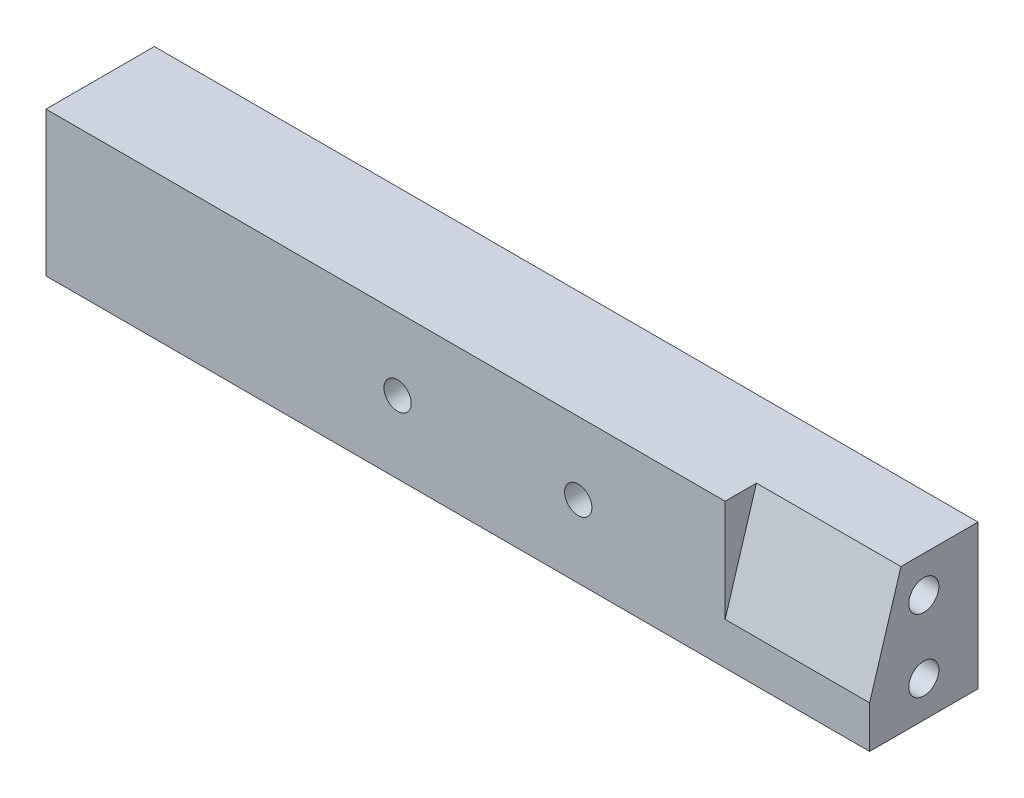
ISO-10303-21;
HEADER;
FILE_DESCRIPTION(('STEP AP214'),'2;1');
FILE_NAME('part.step','',(''),(''),'','','');
FILE_SCHEMA(('AUTOMOTIVE_DESIGN { 1 0 10303 214 1 1 1 1 }'));
ENDSEC;
DATA;
#1=APPLICATION_CONTEXT('core data for automotive mechanical design processes');
#2=APPLICATION_PROTOCOL_DEFINITION('international standard','automotive_design',2000,#1);
#3=PRODUCT_CONTEXT('',#1,'mechanical');
#4=PRODUCT('Part','Part','',(#3));
#5=PRODUCT_RELATED_PRODUCT_CATEGORY('part','',(#4));
#6=PRODUCT_DEFINITION_FORMATION('','',#4);
#7=PRODUCT_DEFINITION_CONTEXT('part definition',#1,'design');
#8=PRODUCT_DEFINITION('design','',#6,#7);
#9=PRODUCT_DEFINITION_SHAPE('','',#8);
#10=(LENGTH_UNIT() NAMED_UNIT(*) SI_UNIT(.MILLI.,.METRE.));
#11=(NAMED_UNIT(*) PLANE_ANGLE_UNIT() SI_UNIT($,.RADIAN.));
#12=(NAMED_UNIT(*) SI_UNIT($,.STERADIAN.) SOLID_ANGLE_UNIT());
#13=UNCERTAINTY_MEASURE_WITH_UNIT(LENGTH_MEASURE(1.E-05),#10,'distance_accuracy_value','');
#14=(GEOMETRIC_REPRESENTATION_CONTEXT(3) GLOBAL_UNCERTAINTY_ASSIGNED_CONTEXT((#13)) GLOBAL_UNIT_ASSIGNED_CONTEXT((#10,
#11,#12)) REPRESENTATION_CONTEXT('',''));
#15=CARTESIAN_POINT('',(0.,0.,0.));
#16=DIRECTION('',(0.,0.,1.));
#17=DIRECTION('',(1.,0.,0.));
#18=AXIS2_PLACEMENT_3D('',#15,#16,#17);
#19=CARTESIAN_POINT('',(68.4,6.,4.5));
#20=DIRECTION('',(0.,-1.,0.));
#21=DIRECTION('',(0.,0.,-1.));
#22=AXIS2_PLACEMENT_3D('',#19,#20,#21);
#23=PLANE('',#22);
#24=DIRECTION('',(1.,0.,0.));
#25=VECTOR('',#24,1.);
#26=CARTESIAN_POINT('',(56.4,6.,1.9));
#27=LINE('',#26,#25);
#28=CARTESIAN_POINT('',(56.4,6.,1.9));
#29=VERTEX_POINT('',#28);
#30=CARTESIAN_POINT('',(68.4,6.,1.9));
#31=VERTEX_POINT('',#30);
#32=EDGE_CURVE('E110',#29,#31,#27,.T.);
#33=ORIENTED_EDGE('',*,*,#32,.T.);
#34=DIRECTION('',(0.,0.,1.));
#35=VECTOR('',#34,1.);
#36=CARTESIAN_POINT('',(68.4,6.,-3.02658526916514));
#37=LINE('',#36,#35);
#38=CARTESIAN_POINT('',(68.4,6.,-4.5));
#39=VERTEX_POINT('',#38);
#40=EDGE_CURVE('E88',#39,#31,#37,.T.);
#41=ORIENTED_EDGE('',*,*,#40,.F.);
#42=DIRECTION('',(-1.,0.,0.));
#43=VECTOR('',#42,1.);
#44=CARTESIAN_POINT('',(68.4,6.,-4.5));
#45=LINE('',#44,#43);
#46=CARTESIAN_POINT('',(0.,6.,-4.5));
#47=VERTEX_POINT('',#46);
#48=EDGE_CURVE('E11',#39,#47,#45,.T.);
#49=ORIENTED_EDGE('',*,*,#48,.T.);
#50=DIRECTION('',(0.,0.,1.));
#51=VECTOR('',#50,1.);
#52=CARTESIAN_POINT('',(0.,6.,4.5));
#53=LINE('',#52,#51);
#54=CARTESIAN_POINT('',(0.,6.,4.5));
#55=VERTEX_POINT('',#54);
#56=EDGE_CURVE('E178',#47,#55,#53,.T.);
#57=ORIENTED_EDGE('',*,*,#56,.T.);
#58=DIRECTION('',(-1.,0.,0.));
#59=VECTOR('',#58,1.);
#60=CARTESIAN_POINT('',(68.4,6.,4.5));
#61=LINE('',#60,#59);
#62=CARTESIAN_POINT('',(56.4,6.,4.5));
#63=VERTEX_POINT('',#62);
#64=EDGE_CURVE('E45',#63,#55,#61,.T.);
#65=ORIENTED_EDGE('',*,*,#64,.F.);
#66=DIRECTION('',(0.,0.,1.));
#67=VECTOR('',#66,1.);
#68=CARTESIAN_POINT('',(56.4,6.,0.));
#69=LINE('',#68,#67);
#70=EDGE_CURVE('E121',#29,#63,#69,.T.);
#71=ORIENTED_EDGE('',*,*,#70,.F.);
#72=EDGE_LOOP('',(#33,#41,#49,#57,#65,#71));
#73=FACE_BOUND('',#72,.T.);
#74=ADVANCED_FACE('F36',(#73),#23,.F.);
#75=CARTESIAN_POINT('',(68.4,-6.,4.5));
#76=DIRECTION('',(0.,0.,-1.));
#77=DIRECTION('',(-1.,0.,0.));
#78=AXIS2_PLACEMENT_3D('',#75,#76,#77);
#79=PLANE('',#78);
#80=CARTESIAN_POINT('',(29.2000000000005,0.,4.5));
#81=DIRECTION('',(0.,0.,-1.));
#82=DIRECTION('',(-1.,0.,0.));
#83=AXIS2_PLACEMENT_3D('',#80,#81,#82);
#84=CIRCLE('',#83,1.13350043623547);
#85=CARTESIAN_POINT('',(28.066499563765,0.,4.5));
#86=VERTEX_POINT('',#85);
#87=EDGE_CURVE('E143',#86,#86,#84,.T.);
#88=ORIENTED_EDGE('',*,*,#87,.T.);
#89=EDGE_LOOP('',(#88));
#90=FACE_BOUND('',#89,.T.);
#91=CARTESIAN_POINT('',(44.2000000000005,0.,4.5));
#92=DIRECTION('',(0.,0.,-1.));
#93=DIRECTION('',(-1.,0.,0.));
#94=AXIS2_PLACEMENT_3D('',#91,#92,#93);
#95=CIRCLE('',#94,1.13350043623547);
#96=CARTESIAN_POINT('',(43.066499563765,0.,4.5));
#97=VERTEX_POINT('',#96);
#98=EDGE_CURVE('E40',#97,#97,#95,.T.);
#99=ORIENTED_EDGE('',*,*,#98,.T.);
#100=EDGE_LOOP('',(#99));
#101=FACE_BOUND('',#100,.T.);
#102=DIRECTION('',(1.,0.,0.));
#103=VECTOR('',#102,1.);
#104=CARTESIAN_POINT('',(56.4,-2.5,4.5));
#105=LINE('',#104,#103);
#106=CARTESIAN_POINT('',(56.4,-2.5,4.5));
#107=VERTEX_POINT('',#106);
#108=CARTESIAN_POINT('',(68.4,-2.5,4.5));
#109=VERTEX_POINT('',#108);
#110=EDGE_CURVE('E53',#107,#109,#105,.T.);
#111=ORIENTED_EDGE('',*,*,#110,.F.);
#112=DIRECTION('',(0.,-1.,0.));
#113=VECTOR('',#112,1.);
#114=CARTESIAN_POINT('',(56.4,0.,4.5));
#115=LINE('',#114,#113);
#116=EDGE_CURVE('E117',#63,#107,#115,.T.);
#117=ORIENTED_EDGE('',*,*,#116,.F.);
#118=ORIENTED_EDGE('',*,*,#64,.T.);
#119=DIRECTION('',(0.,-1.,0.));
#120=VECTOR('',#119,1.);
#121=CARTESIAN_POINT('',(0.,-6.,4.5));
#122=LINE('',#121,#120);
#123=CARTESIAN_POINT('',(0.,-6.,4.5));
#124=VERTEX_POINT('',#123);
#125=EDGE_CURVE('E180',#55,#124,#122,.T.);
#126=ORIENTED_EDGE('',*,*,#125,.T.);
#127=DIRECTION('',(-1.,0.,0.));
#128=VECTOR('',#127,1.);
#129=CARTESIAN_POINT('',(68.4,-6.,4.5));
#130=LINE('',#129,#128);
#131=CARTESIAN_POINT('',(68.4,-6.,4.5));
#132=VERTEX_POINT('',#131);
#133=EDGE_CURVE('E184',#132,#124,#130,.T.);
#134=ORIENTED_EDGE('',*,*,#133,.F.);
#135=DIRECTION('',(0.,-1.,0.));
#136=VECTOR('',#135,1.);
#137=CARTESIAN_POINT('',(68.4,-6.,4.5));
#138=LINE('',#137,#136);
#139=EDGE_CURVE('E172',#109,#132,#138,.T.);
#140=ORIENTED_EDGE('',*,*,#139,.F.);
#141=EDGE_LOOP('',(#111,#117,#118,#126,#134,#140));
#142=FACE_BOUND('',#141,.T.);
#143=ADVANCED_FACE('F189',(#90,#101,#142),#79,.F.);
#144=CARTESIAN_POINT('',(68.4,0.,0.));
#145=DIRECTION('',(1.,0.,0.));
#146=DIRECTION('',(0.,0.,-1.));
#147=AXIS2_PLACEMENT_3D('',#144,#145,#146);
#148=PLANE('',#147);
#149=CARTESIAN_POINT('',(68.4,-3.,0.));
#150=DIRECTION('',(1.,0.,0.));
#151=DIRECTION('',(0.,0.,-1.));
#152=AXIS2_PLACEMENT_3D('',#149,#150,#151);
#153=CIRCLE('',#152,1.24999999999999);
#154=CARTESIAN_POINT('',(68.4,-3.,-1.24999999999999));
#155=VERTEX_POINT('',#154);
#156=EDGE_CURVE('E156',#155,#155,#153,.T.);
#157=ORIENTED_EDGE('',*,*,#156,.F.);
#158=EDGE_LOOP('',(#157));
#159=FACE_BOUND('',#158,.T.);
#160=CARTESIAN_POINT('',(68.4,3.,0.));
#161=DIRECTION('',(1.,0.,0.));
#162=DIRECTION('',(0.,0.,-1.));
#163=AXIS2_PLACEMENT_3D('',#160,#161,#162);
#164=CIRCLE('',#163,1.24999999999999);
#165=CARTESIAN_POINT('',(68.4,3.,-1.24999999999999));
#166=VERTEX_POINT('',#165);
#167=EDGE_CURVE('E162',#166,#166,#164,.T.);
#168=ORIENTED_EDGE('',*,*,#167,.F.);
#169=EDGE_LOOP('',(#168));
#170=FACE_BOUND('',#169,.T.);
#171=ORIENTED_EDGE('',*,*,#40,.T.);
#172=DIRECTION('',(0.,-0.956264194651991,0.29250434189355));
#173=VECTOR('',#172,1.);
#174=CARTESIAN_POINT('',(68.4,1.04480445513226,3.41570687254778));
#175=LINE('',#174,#173);
#176=EDGE_CURVE('E115',#31,#109,#175,.T.);
#177=ORIENTED_EDGE('',*,*,#176,.T.);
#178=ORIENTED_EDGE('',*,*,#139,.T.);
#179=DIRECTION('',(0.,0.,-1.));
#180=VECTOR('',#179,1.);
#181=CARTESIAN_POINT('',(68.4,-6.,4.5));
#182=LINE('',#181,#180);
#183=CARTESIAN_POINT('',(68.4,-6.,-4.5));
#184=VERTEX_POINT('',#183);
#185=EDGE_CURVE('E62',#132,#184,#182,.T.);
#186=ORIENTED_EDGE('',*,*,#185,.T.);
#187=DIRECTION('',(0.,1.,0.));
#188=VECTOR('',#187,1.);
#189=CARTESIAN_POINT('',(68.4,6.,-4.5));
#190=LINE('',#189,#188);
#191=EDGE_CURVE('E169',#184,#39,#190,.T.);
#192=ORIENTED_EDGE('',*,*,#191,.T.);
#193=EDGE_LOOP('',(#171,#177,#178,#186,#192));
#194=FACE_BOUND('',#193,.T.);
#195=ADVANCED_FACE('F212',(#159,#170,#194),#148,.T.);
#196=CARTESIAN_POINT('',(68.4,6.,-4.5));
#197=DIRECTION('',(0.,0.,1.));
#198=DIRECTION('',(1.,0.,0.));
#199=AXIS2_PLACEMENT_3D('',#196,#197,#198);
#200=PLANE('',#199);
#201=CARTESIAN_POINT('',(44.2000000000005,0.,-4.5));
#202=DIRECTION('',(0.,0.,-1.));
#203=DIRECTION('',(-1.,0.,0.));
#204=AXIS2_PLACEMENT_3D('',#201,#202,#203);
#205=CIRCLE('',#204,1.24999999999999);
#206=CARTESIAN_POINT('',(42.9500000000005,0.,-4.5));
#207=VERTEX_POINT('',#206);
#208=EDGE_CURVE('E130',#207,#207,#205,.T.);
#209=ORIENTED_EDGE('',*,*,#208,.F.);
#210=EDGE_LOOP('',(#209));
#211=FACE_BOUND('',#210,.T.);
#212=CARTESIAN_POINT('',(29.2000000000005,0.,-4.5));
#213=DIRECTION('',(0.,0.,-1.));
#214=DIRECTION('',(-1.,0.,0.));
#215=AXIS2_PLACEMENT_3D('',#212,#213,#214);
#216=CIRCLE('',#215,1.24999999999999);
#217=CARTESIAN_POINT('',(27.9500000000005,0.,-4.5));
#218=VERTEX_POINT('',#217);
#219=EDGE_CURVE('E137',#218,#218,#216,.T.);
#220=ORIENTED_EDGE('',*,*,#219,.F.);
#221=EDGE_LOOP('',(#220));
#222=FACE_BOUND('',#221,.T.);
#223=DIRECTION('',(0.,1.,0.));
#224=VECTOR('',#223,1.);
#225=CARTESIAN_POINT('',(0.,6.,-4.5));
#226=LINE('',#225,#224);
#227=CARTESIAN_POINT('',(0.,-6.,-4.5));
#228=VERTEX_POINT('',#227);
#229=EDGE_CURVE('E168',#228,#47,#226,.T.);
#230=ORIENTED_EDGE('',*,*,#229,.T.);
#231=ORIENTED_EDGE('',*,*,#48,.F.);
#232=ORIENTED_EDGE('',*,*,#191,.F.);
#233=DIRECTION('',(-1.,0.,0.));
#234=VECTOR('',#233,1.);
#235=CARTESIAN_POINT('',(68.4,-6.,-4.5));
#236=LINE('',#235,#234);
#237=EDGE_CURVE('E175',#184,#228,#236,.T.);
#238=ORIENTED_EDGE('',*,*,#237,.T.);
#239=EDGE_LOOP('',(#230,#231,#232,#238));
#240=FACE_BOUND('',#239,.T.);
#241=ADVANCED_FACE('F38',(#211,#222,#240),#200,.F.);
#242=CARTESIAN_POINT('',(68.4,-6.,4.5));
#243=DIRECTION('',(0.,1.,0.));
#244=DIRECTION('',(0.,0.,1.));
#245=AXIS2_PLACEMENT_3D('',#242,#243,#244);
#246=PLANE('',#245);
#247=DIRECTION('',(0.,0.,-1.));
#248=VECTOR('',#247,1.);
#249=CARTESIAN_POINT('',(0.,-6.,4.5));
#250=LINE('',#249,#248);
#251=EDGE_CURVE('E82',#124,#228,#250,.T.);
#252=ORIENTED_EDGE('',*,*,#251,.T.);
#253=ORIENTED_EDGE('',*,*,#237,.F.);
#254=ORIENTED_EDGE('',*,*,#185,.F.);
#255=ORIENTED_EDGE('',*,*,#133,.T.);
#256=EDGE_LOOP('',(#252,#253,#254,#255));
#257=FACE_BOUND('',#256,.T.);
#258=ADVANCED_FACE('F215',(#257),#246,.F.);
#259=CARTESIAN_POINT('',(0.,0.,0.));
#260=DIRECTION('',(1.,0.,0.));
#261=DIRECTION('',(0.,0.,-1.));
#262=AXIS2_PLACEMENT_3D('',#259,#260,#261);
#263=PLANE('',#262);
#264=CARTESIAN_POINT('',(0.,3.,0.));
#265=DIRECTION('',(-1.,0.,0.));
#266=DIRECTION('',(0.,0.,1.));
#267=AXIS2_PLACEMENT_3D('',#264,#265,#266);
#268=CIRCLE('',#267,1.24999999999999);
#269=CARTESIAN_POINT('',(0.,3.,1.24999999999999));
#270=VERTEX_POINT('',#269);
#271=EDGE_CURVE('E144',#270,#270,#268,.T.);
#272=ORIENTED_EDGE('',*,*,#271,.F.);
#273=EDGE_LOOP('',(#272));
#274=FACE_BOUND('',#273,.T.);
#275=CARTESIAN_POINT('',(0.,-3.,0.));
#276=DIRECTION('',(-1.,0.,0.));
#277=DIRECTION('',(0.,0.,1.));
#278=AXIS2_PLACEMENT_3D('',#275,#276,#277);
#279=CIRCLE('',#278,1.24999999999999);
#280=CARTESIAN_POINT('',(0.,-3.,1.24999999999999));
#281=VERTEX_POINT('',#280);
#282=EDGE_CURVE('E150',#281,#281,#279,.T.);
#283=ORIENTED_EDGE('',*,*,#282,.F.);
#284=EDGE_LOOP('',(#283));
#285=FACE_BOUND('',#284,.T.);
#286=ORIENTED_EDGE('',*,*,#229,.F.);
#287=ORIENTED_EDGE('',*,*,#251,.F.);
#288=ORIENTED_EDGE('',*,*,#125,.F.);
#289=ORIENTED_EDGE('',*,*,#56,.F.);
#290=EDGE_LOOP('',(#286,#287,#288,#289));
#291=FACE_BOUND('',#290,.T.);
#292=ADVANCED_FACE('F218',(#274,#285,#291),#263,.F.);
#293=CARTESIAN_POINT('',(59.9,3.,0.));
#294=DIRECTION('',(1.,0.,0.));
#295=DIRECTION('',(0.,0.,-1.));
#296=AXIS2_PLACEMENT_3D('',#293,#294,#295);
#297=CONICAL_SURFACE('',#296,1.25,1.02974425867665);
#298=CARTESIAN_POINT('',(59.1489242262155,3.,0.));
#299=VERTEX_POINT('',#298);
#300=VERTEX_LOOP('',#299);
#301=FACE_BOUND('',#300,.T.);
#302=CARTESIAN_POINT('',(59.9,3.,0.));
#303=DIRECTION('',(1.,0.,0.));
#304=DIRECTION('',(0.,0.,-1.));
#305=AXIS2_PLACEMENT_3D('',#302,#303,#304);
#306=CIRCLE('',#305,1.25);
#307=CARTESIAN_POINT('',(59.9,3.,-1.25));
#308=VERTEX_POINT('',#307);
#309=EDGE_CURVE('E165',#308,#308,#306,.T.);
#310=ORIENTED_EDGE('',*,*,#309,.T.);
#311=EDGE_LOOP('',(#310));
#312=FACE_BOUND('',#311,.T.);
#313=ADVANCED_FACE('F221',(#301,#312),#297,.F.);
#314=CARTESIAN_POINT('',(68.4,3.,0.));
#315=DIRECTION('',(1.,0.,0.));
#316=DIRECTION('',(0.,0.,-1.));
#317=AXIS2_PLACEMENT_3D('',#314,#315,#316);
#318=CYLINDRICAL_SURFACE('',#317,1.24999999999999);
#319=ORIENTED_EDGE('',*,*,#309,.F.);
#320=EDGE_LOOP('',(#319));
#321=FACE_BOUND('',#320,.T.);
#322=ORIENTED_EDGE('',*,*,#167,.T.);
#323=EDGE_LOOP('',(#322));
#324=FACE_BOUND('',#323,.T.);
#325=ADVANCED_FACE('F228',(#321,#324),#318,.F.);
#326=CARTESIAN_POINT('',(59.9,-3.,0.));
#327=DIRECTION('',(1.,0.,0.));
#328=DIRECTION('',(0.,0.,-1.));
#329=AXIS2_PLACEMENT_3D('',#326,#327,#328);
#330=CONICAL_SURFACE('',#329,1.25,1.02974425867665);
#331=CARTESIAN_POINT('',(59.1489242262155,-3.,0.));
#332=VERTEX_POINT('',#331);
#333=VERTEX_LOOP('',#332);
#334=FACE_BOUND('',#333,.T.);
#335=CARTESIAN_POINT('',(59.9,-3.,0.));
#336=DIRECTION('',(1.,0.,0.));
#337=DIRECTION('',(0.,0.,-1.));
#338=AXIS2_PLACEMENT_3D('',#335,#336,#337);
#339=CIRCLE('',#338,1.25);
#340=CARTESIAN_POINT('',(59.9,-3.,-1.25));
#341=VERTEX_POINT('',#340);
#342=EDGE_CURVE('E159',#341,#341,#339,.T.);
#343=ORIENTED_EDGE('',*,*,#342,.T.);
#344=EDGE_LOOP('',(#343));
#345=FACE_BOUND('',#344,.T.);
#346=ADVANCED_FACE('F232',(#334,#345),#330,.F.);
#347=CARTESIAN_POINT('',(68.4,-3.,0.));
#348=DIRECTION('',(1.,0.,0.));
#349=DIRECTION('',(0.,0.,-1.));
#350=AXIS2_PLACEMENT_3D('',#347,#348,#349);
#351=CYLINDRICAL_SURFACE('',#350,1.24999999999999);
#352=ORIENTED_EDGE('',*,*,#342,.F.);
#353=EDGE_LOOP('',(#352));
#354=FACE_BOUND('',#353,.T.);
#355=ORIENTED_EDGE('',*,*,#156,.T.);
#356=EDGE_LOOP('',(#355));
#357=FACE_BOUND('',#356,.T.);
#358=ADVANCED_FACE('F236',(#354,#357),#351,.F.);
#359=CARTESIAN_POINT('',(8.49999999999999,-3.,0.));
#360=DIRECTION('',(-1.,0.,0.));
#361=DIRECTION('',(0.,0.,1.));
#362=AXIS2_PLACEMENT_3D('',#359,#360,#361);
#363=CONICAL_SURFACE('',#362,1.24999999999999,1.02974425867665);
#364=CARTESIAN_POINT('',(9.25107577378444,-3.,0.));
#365=VERTEX_POINT('',#364);
#366=VERTEX_LOOP('',#365);
#367=FACE_BOUND('',#366,.T.);
#368=CARTESIAN_POINT('',(8.49999999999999,-3.,0.));
#369=DIRECTION('',(-1.,0.,0.));
#370=DIRECTION('',(0.,0.,1.));
#371=AXIS2_PLACEMENT_3D('',#368,#369,#370);
#372=CIRCLE('',#371,1.24999999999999);
#373=CARTESIAN_POINT('',(8.49999999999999,-3.,1.24999999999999));
#374=VERTEX_POINT('',#373);
#375=EDGE_CURVE('E153',#374,#374,#372,.T.);
#376=ORIENTED_EDGE('',*,*,#375,.T.);
#377=EDGE_LOOP('',(#376));
#378=FACE_BOUND('',#377,.T.);
#379=ADVANCED_FACE('F240',(#367,#378),#363,.F.);
#380=CARTESIAN_POINT('',(0.,-3.,0.));
#381=DIRECTION('',(-1.,0.,0.));
#382=DIRECTION('',(0.,0.,1.));
#383=AXIS2_PLACEMENT_3D('',#380,#381,#382);
#384=CYLINDRICAL_SURFACE('',#383,1.24999999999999);
#385=ORIENTED_EDGE('',*,*,#375,.F.);
#386=EDGE_LOOP('',(#385));
#387=FACE_BOUND('',#386,.T.);
#388=ORIENTED_EDGE('',*,*,#282,.T.);
#389=EDGE_LOOP('',(#388));
#390=FACE_BOUND('',#389,.T.);
#391=ADVANCED_FACE('F244',(#387,#390),#384,.F.);
#392=CARTESIAN_POINT('',(8.49999999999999,3.,0.));
#393=DIRECTION('',(-1.,0.,0.));
#394=DIRECTION('',(0.,0.,1.));
#395=AXIS2_PLACEMENT_3D('',#392,#393,#394);
#396=CONICAL_SURFACE('',#395,1.24999999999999,1.02974425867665);
#397=CARTESIAN_POINT('',(9.25107577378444,3.,0.));
#398=VERTEX_POINT('',#397);
#399=VERTEX_LOOP('',#398);
#400=FACE_BOUND('',#399,.T.);
#401=CARTESIAN_POINT('',(8.49999999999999,3.,0.));
#402=DIRECTION('',(-1.,0.,0.));
#403=DIRECTION('',(0.,0.,1.));
#404=AXIS2_PLACEMENT_3D('',#401,#402,#403);
#405=CIRCLE('',#404,1.24999999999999);
#406=CARTESIAN_POINT('',(8.49999999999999,3.,1.24999999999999));
#407=VERTEX_POINT('',#406);
#408=EDGE_CURVE('E147',#407,#407,#405,.T.);
#409=ORIENTED_EDGE('',*,*,#408,.T.);
#410=EDGE_LOOP('',(#409));
#411=FACE_BOUND('',#410,.T.);
#412=ADVANCED_FACE('F205',(#400,#411),#396,.F.);
#413=CARTESIAN_POINT('',(0.,3.,0.));
#414=DIRECTION('',(-1.,0.,0.));
#415=DIRECTION('',(0.,0.,1.));
#416=AXIS2_PLACEMENT_3D('',#413,#414,#415);
#417=CYLINDRICAL_SURFACE('',#416,1.24999999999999);
#418=ORIENTED_EDGE('',*,*,#408,.F.);
#419=EDGE_LOOP('',(#418));
#420=FACE_BOUND('',#419,.T.);
#421=ORIENTED_EDGE('',*,*,#271,.T.);
#422=EDGE_LOOP('',(#421));
#423=FACE_BOUND('',#422,.T.);
#424=ADVANCED_FACE('F195',(#420,#423),#417,.F.);
#425=CARTESIAN_POINT('',(29.2000000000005,0.,4.43));
#426=DIRECTION('',(0.,0.,-1.));
#427=DIRECTION('',(-1.,0.,0.));
#428=AXIS2_PLACEMENT_3D('',#425,#426,#427);
#429=CONICAL_SURFACE('',#428,1.25,1.02974425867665);
#430=CARTESIAN_POINT('',(29.2000000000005,0.,4.43));
#431=DIRECTION('',(0.,0.,-1.));
#432=DIRECTION('',(-1.,0.,0.));
#433=AXIS2_PLACEMENT_3D('',#430,#431,#432);
#434=CIRCLE('',#433,1.25);
#435=CARTESIAN_POINT('',(27.9500000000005,0.,4.43));
#436=VERTEX_POINT('',#435);
#437=EDGE_CURVE('E140',#436,#436,#434,.T.);
#438=ORIENTED_EDGE('',*,*,#437,.T.);
#439=EDGE_LOOP('',(#438));
#440=FACE_BOUND('',#439,.T.);
#441=ORIENTED_EDGE('',*,*,#87,.F.);
#442=EDGE_LOOP('',(#441));
#443=FACE_BOUND('',#442,.T.);
#444=ADVANCED_FACE('F192',(#440,#443),#429,.F.);
#445=CARTESIAN_POINT('',(29.2000000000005,0.,-4.5));
#446=DIRECTION('',(0.,0.,-1.));
#447=DIRECTION('',(-1.,0.,0.));
#448=AXIS2_PLACEMENT_3D('',#445,#446,#447);
#449=CYLINDRICAL_SURFACE('',#448,1.24999999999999);
#450=ORIENTED_EDGE('',*,*,#437,.F.);
#451=EDGE_LOOP('',(#450));
#452=FACE_BOUND('',#451,.T.);
#453=ORIENTED_EDGE('',*,*,#219,.T.);
#454=EDGE_LOOP('',(#453));
#455=FACE_BOUND('',#454,.T.);
#456=ADVANCED_FACE('F194',(#452,#455),#449,.F.);
#457=CARTESIAN_POINT('',(44.2000000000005,0.,4.43));
#458=DIRECTION('',(0.,0.,-1.));
#459=DIRECTION('',(-1.,0.,0.));
#460=AXIS2_PLACEMENT_3D('',#457,#458,#459);
#461=CONICAL_SURFACE('',#460,1.25,1.02974425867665);
#462=CARTESIAN_POINT('',(44.2000000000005,0.,4.43));
#463=DIRECTION('',(0.,0.,-1.));
#464=DIRECTION('',(-1.,0.,0.));
#465=AXIS2_PLACEMENT_3D('',#462,#463,#464);
#466=CIRCLE('',#465,1.25);
#467=CARTESIAN_POINT('',(42.9500000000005,0.,4.43));
#468=VERTEX_POINT('',#467);
#469=EDGE_CURVE('E134',#468,#468,#466,.T.);
#470=ORIENTED_EDGE('',*,*,#469,.T.);
#471=EDGE_LOOP('',(#470));
#472=FACE_BOUND('',#471,.T.);
#473=ORIENTED_EDGE('',*,*,#98,.F.);
#474=EDGE_LOOP('',(#473));
#475=FACE_BOUND('',#474,.T.);
#476=ADVANCED_FACE('F202',(#472,#475),#461,.F.);
#477=CARTESIAN_POINT('',(44.2000000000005,0.,-4.5));
#478=DIRECTION('',(0.,0.,-1.));
#479=DIRECTION('',(-1.,0.,0.));
#480=AXIS2_PLACEMENT_3D('',#477,#478,#479);
#481=CYLINDRICAL_SURFACE('',#480,1.24999999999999);
#482=ORIENTED_EDGE('',*,*,#469,.F.);
#483=EDGE_LOOP('',(#482));
#484=FACE_BOUND('',#483,.T.);
#485=ORIENTED_EDGE('',*,*,#208,.T.);
#486=EDGE_LOOP('',(#485));
#487=FACE_BOUND('',#486,.T.);
#488=ADVANCED_FACE('F277',(#484,#487),#481,.F.);
#489=CARTESIAN_POINT('',(56.4,1.04480445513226,3.41570687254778));
#490=DIRECTION('',(0.,0.29250434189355,0.956264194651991));
#491=DIRECTION('',(0.,-0.956264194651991,0.29250434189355));
#492=AXIS2_PLACEMENT_3D('',#489,#490,#491);
#493=PLANE('',#492);
#494=ORIENTED_EDGE('',*,*,#176,.F.);
#495=ORIENTED_EDGE('',*,*,#32,.F.);
#496=DIRECTION('',(0.,-0.956264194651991,0.29250434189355));
#497=VECTOR('',#496,1.);
#498=CARTESIAN_POINT('',(56.4,1.04480445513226,3.41570687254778));
#499=LINE('',#498,#497);
#500=EDGE_CURVE('E113',#29,#107,#499,.T.);
#501=ORIENTED_EDGE('',*,*,#500,.T.);
#502=ORIENTED_EDGE('',*,*,#110,.T.);
#503=EDGE_LOOP('',(#494,#495,#501,#502));
#504=FACE_BOUND('',#503,.T.);
#505=ADVANCED_FACE('F112',(#504),#493,.T.);
#506=CARTESIAN_POINT('',(56.4,0.,0.));
#507=DIRECTION('',(1.,0.,0.));
#508=DIRECTION('',(0.,0.,-1.));
#509=AXIS2_PLACEMENT_3D('',#506,#507,#508);
#510=PLANE('',#509);
#511=ORIENTED_EDGE('',*,*,#500,.F.);
#512=ORIENTED_EDGE('',*,*,#70,.T.);
#513=ORIENTED_EDGE('',*,*,#116,.T.);
#514=EDGE_LOOP('',(#511,#512,#513));
#515=FACE_BOUND('',#514,.T.);
#516=ADVANCED_FACE('F120',(#515),#510,.T.);
#517=CLOSED_SHELL('',(#74,#143,#195,#241,#258,#292,#313,#325,#346,#358,#379,#391,#412,#424,#444,
#456,#476,#488,#505,#516));
#518=MANIFOLD_SOLID_BREP('B2',#517);
#519=ADVANCED_BREP_SHAPE_REPRESENTATION('',(#18,#518),#14);
#520=SHAPE_DEFINITION_REPRESENTATION(#9,#519);
ENDSEC;
END-ISO-10303-21;
